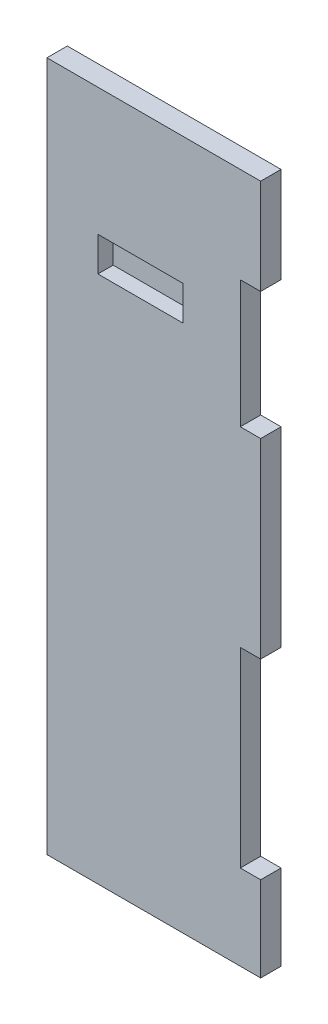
from build123d import *

# Parameters (mm, degrees)
BOSS_EXTRUDE1_DEPTH = 16
SKETCH3_W           = 67
SKETCH3_H           = 27
CUT_EXTRUDE1_DEPTH  = 12
SKETCH4_W           = 43
SKETCH4_H           = 4
CUT_EXTRUDE2_DEPTH  = 6


with BuildPart() as part:
    # Sketch1 → Boss-Extrude1 (new body)
    with BuildSketch(Plane.XY):
        Polygon((0, 76.2), (0, 618), (167.8, 618), (167.8, 543), (151.8, 543), (151.8, 443), (167.8, 443), (167.8, 293), (151.8, 293), (151.8, 143), (167.8, 143), (167.8, 76.2), align=None)
    extrude(amount=BOSS_EXTRUDE1_DEPTH)

    # Sketch3 → Cut-Extrude1 (cut)
    with BuildSketch(Plane.XY.offset(16)):
        with Locations((73.5, 504.5)):
            Rectangle(SKETCH3_W, SKETCH3_H)
    extrude(amount=-CUT_EXTRUDE1_DEPTH, mode=Mode.SUBTRACT)

    # Sketch4 → Cut-Extrude2 (cut)
    with BuildSketch(Plane.XY.offset(4)):
        with Locations((85.5, 516)):
            Rectangle(SKETCH4_W, SKETCH4_H)
    extrude(amount=-CUT_EXTRUDE2_DEPTH, mode=Mode.SUBTRACT)


solid = part.part
